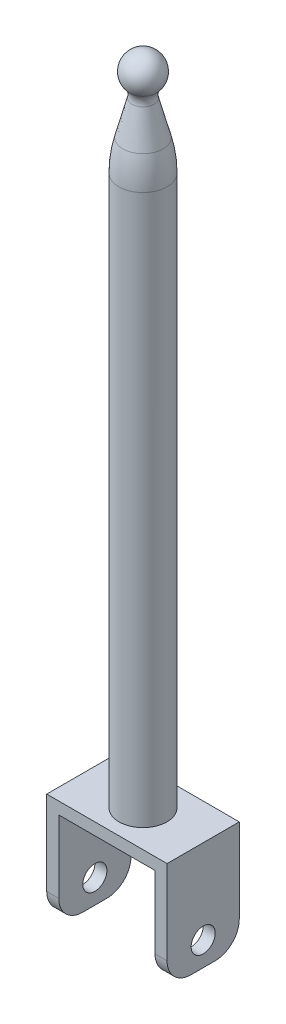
from build123d import *

# Parameters (mm, degrees)
CUT_EXTRUDE1_START  = -35
SKETCH2_R           = 10
CUT_EXTRUDE1_DEPTH  = 35
SKETCH3_W           = 50
SKETCH3_H           = 30
BOSS_EXTRUDE1_DEPTH = 45
SKETCH4_W           = 30
SKETCH4_H           = 30
CUT_EXTRUDE2_DEPTH  = 40
SKETCH5_W           = 5
SKETCH5_H           = 30
CUT_EXTRUDE3_DEPTH  = 40
SKETCH6_W           = 5
SKETCH6_H           = 30
CUT_EXTRUDE4_DEPTH  = 40
SKETCH7_R           = 5
CUT_EXTRUDE5_DEPTH  = 50
FILLET1_R           = 10


with BuildPart() as part:
    # Sketch1 → Revolve5 (revolve)
    with BuildSketch(Plane.XY, mode=Mode.PRIVATE) as revolve5_sk:
        with BuildLine():
            Line((0, 0), (10, 0))
            Line((10, 0), (10, 263.490847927))
            ThreePointArc((10, 263.490847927), (9.581619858, 269.945534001), (8.333481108, 276.292199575))
            Line((8.333481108, 276.292199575), (4.573590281, 290.488248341))
            ThreePointArc((4.573590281, 290.488248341), (4.538579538, 292.908156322), (5.644163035, 295.061030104))
            ThreePointArc((5.644163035, 295.061030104), (6.829797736, 303.099009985), (0, 307.5))
            Line((0, 307.5), (0, 0))
        make_face()
    revolve(revolve5_sk.sketch.rotate(Axis((0, 331.861889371, 0), (0, -1, 0)), 90), axis=Axis((0, 331.861889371, 0), (0, -1, 0)))

    # Sketch2 → Cut-Extrude1 (cut)
    with BuildSketch(Plane.XZ.offset(CUT_EXTRUDE1_START)):
        with Locations(Location((0, 0, 0), (0, 0, 90))):
            Circle(SKETCH2_R)
    extrude(amount=CUT_EXTRUDE1_DEPTH, mode=Mode.SUBTRACT)

    # Sketch3 → Boss-Extrude1 (add)
    with BuildSketch(Plane.XZ.offset(-35)):
        Rectangle(SKETCH3_W, SKETCH3_H)
    extrude(amount=BOSS_EXTRUDE1_DEPTH)

    # Sketch4 → Cut-Extrude2 (cut)
    with BuildSketch(Plane.XZ.offset(10)):
        Rectangle(SKETCH4_W, SKETCH4_H)
    extrude(amount=-CUT_EXTRUDE2_DEPTH, mode=Mode.SUBTRACT)

    # Sketch5 → Cut-Extrude3 (cut)
    with BuildSketch(Plane.XZ.offset(10)):
        with Locations((-17.5, 0)):
            Rectangle(SKETCH5_W, SKETCH5_H)
    extrude(amount=-CUT_EXTRUDE3_DEPTH, mode=Mode.SUBTRACT)

    # Sketch6 → Cut-Extrude4 (cut)
    with BuildSketch(Plane.XZ.offset(10)):
        with Locations((17.5, 0)):
            Rectangle(SKETCH6_W, SKETCH6_H)
    extrude(amount=-CUT_EXTRUDE4_DEPTH, mode=Mode.SUBTRACT)

    # Sketch7 → Cut-Extrude5 (cut)
    with BuildSketch(Plane.ZY.offset(25)):
        Circle(SKETCH7_R)
    extrude(amount=-CUT_EXTRUDE5_DEPTH, mode=Mode.SUBTRACT)

    # Fillet1
    fillet1_edges = [part.edges().sort_by_distance(p)[0] for p in [
        (22.5, -10, 15),
        (-22.5, -10, -15),
        (-22.5, -10, 15),
        (22.5, -10, -15),
    ]]
    fillet(fillet1_edges, radius=FILLET1_R)


solid = part.part
